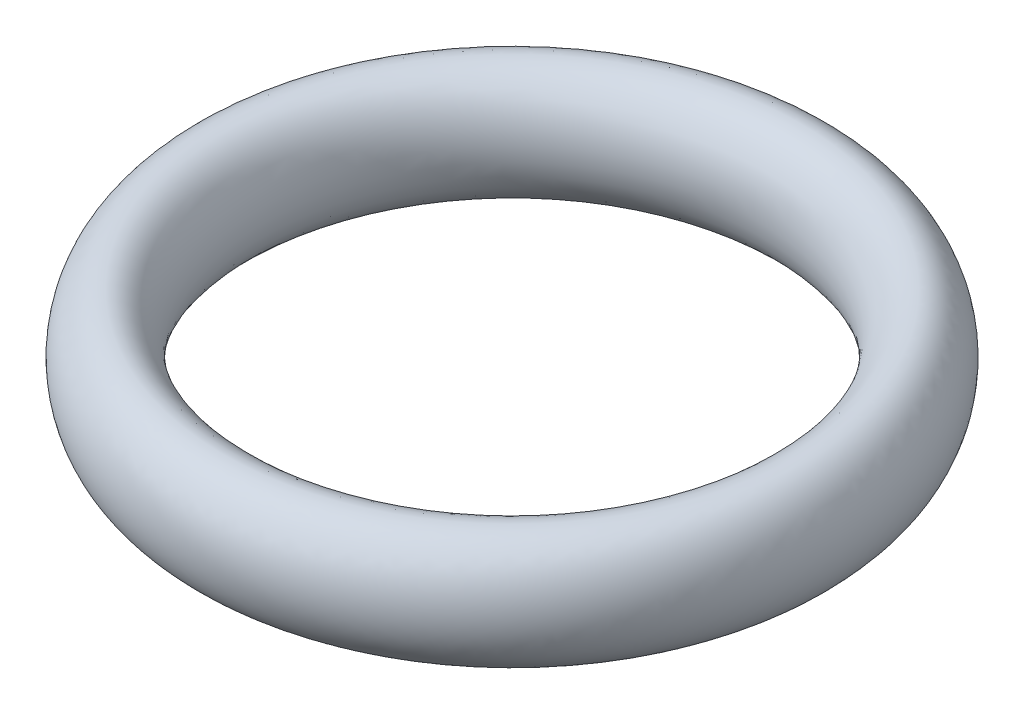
ISO-10303-21;
HEADER;
FILE_DESCRIPTION(('STEP AP214'),'2;1');
FILE_NAME('part.step','',(''),(''),'','','');
FILE_SCHEMA(('AUTOMOTIVE_DESIGN { 1 0 10303 214 1 1 1 1 }'));
ENDSEC;
DATA;
#1=APPLICATION_CONTEXT('core data for automotive mechanical design processes');
#2=APPLICATION_PROTOCOL_DEFINITION('international standard','automotive_design',2000,#1);
#3=PRODUCT_CONTEXT('',#1,'mechanical');
#4=PRODUCT('Part','Part','',(#3));
#5=PRODUCT_RELATED_PRODUCT_CATEGORY('part','',(#4));
#6=PRODUCT_DEFINITION_FORMATION('','',#4);
#7=PRODUCT_DEFINITION_CONTEXT('part definition',#1,'design');
#8=PRODUCT_DEFINITION('design','',#6,#7);
#9=PRODUCT_DEFINITION_SHAPE('','',#8);
#10=(LENGTH_UNIT() NAMED_UNIT(*) SI_UNIT(.MILLI.,.METRE.));
#11=(NAMED_UNIT(*) PLANE_ANGLE_UNIT() SI_UNIT($,.RADIAN.));
#12=(NAMED_UNIT(*) SI_UNIT($,.STERADIAN.) SOLID_ANGLE_UNIT());
#13=UNCERTAINTY_MEASURE_WITH_UNIT(LENGTH_MEASURE(1.E-05),#10,'distance_accuracy_value','');
#14=(GEOMETRIC_REPRESENTATION_CONTEXT(3) GLOBAL_UNCERTAINTY_ASSIGNED_CONTEXT((#13)) GLOBAL_UNIT_ASSIGNED_CONTEXT((#10,
#11,#12)) REPRESENTATION_CONTEXT('',''));
#15=CARTESIAN_POINT('',(0.,0.,0.));
#16=DIRECTION('',(0.,0.,1.));
#17=DIRECTION('',(1.,0.,0.));
#18=AXIS2_PLACEMENT_3D('',#15,#16,#17);
#19=CARTESIAN_POINT('',(4.3561,0.88899999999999,0.));
#20=DIRECTION('',(0.,0.,1.));
#21=DIRECTION('',(0.,1.,0.));
#22=AXIS2_PLACEMENT_3D('',#19,#20,#21);
#23=ELLIPSE('',#22,0.889,0.635);
#24=CARTESIAN_POINT('',(0.,0.,0.));
#25=DIRECTION('',(0.,-1.,0.));
#26=AXIS1_PLACEMENT('',#24,#25);
#27=SURFACE_OF_REVOLUTION('',#23,#26);
#28=ADVANCED_FACE('F25',(),#27,.F.);
#29=CLOSED_SHELL('',(#28));
#30=MANIFOLD_SOLID_BREP('B2',#29);
#31=ADVANCED_BREP_SHAPE_REPRESENTATION('',(#18,#30),#14);
#32=SHAPE_DEFINITION_REPRESENTATION(#9,#31);
ENDSEC;
END-ISO-10303-21;
